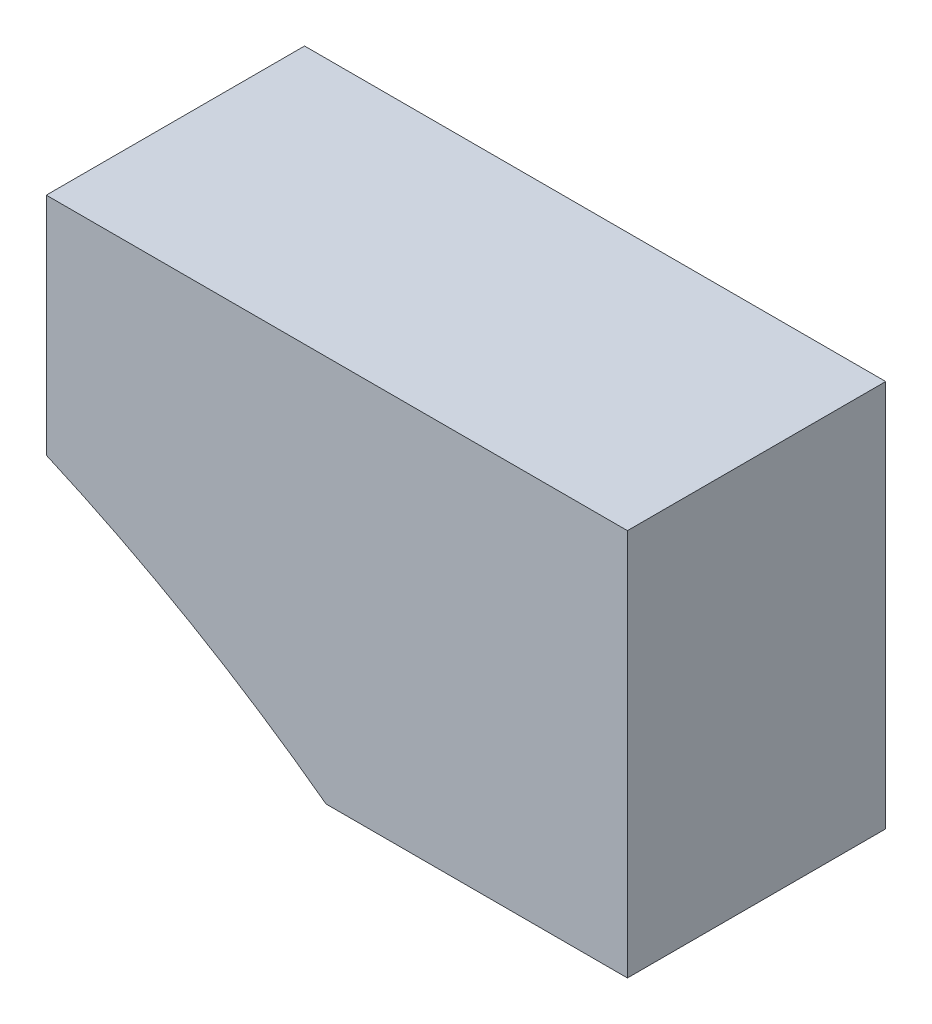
from build123d import *

# Parameters (mm, degrees)
EXTRUSION1_DEPTH = 20


with BuildPart() as part:
    # Esquisse1 → Extrusion1 (new body)
    with BuildSketch(Plane.XY):
        with BuildLine():
            Line((66.66333325, 90), (90, 90))
            Line((90, 90), (90, 120))
            Line((90, 120), (45, 120))
            Line((45, 120), (45, 102.562176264))
            ThreePointArc((45, 102.562176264), (56.183868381, 96.888456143), (66.66333325, 90))
        make_face()
    extrude(amount=EXTRUSION1_DEPTH)


solid = part.part
